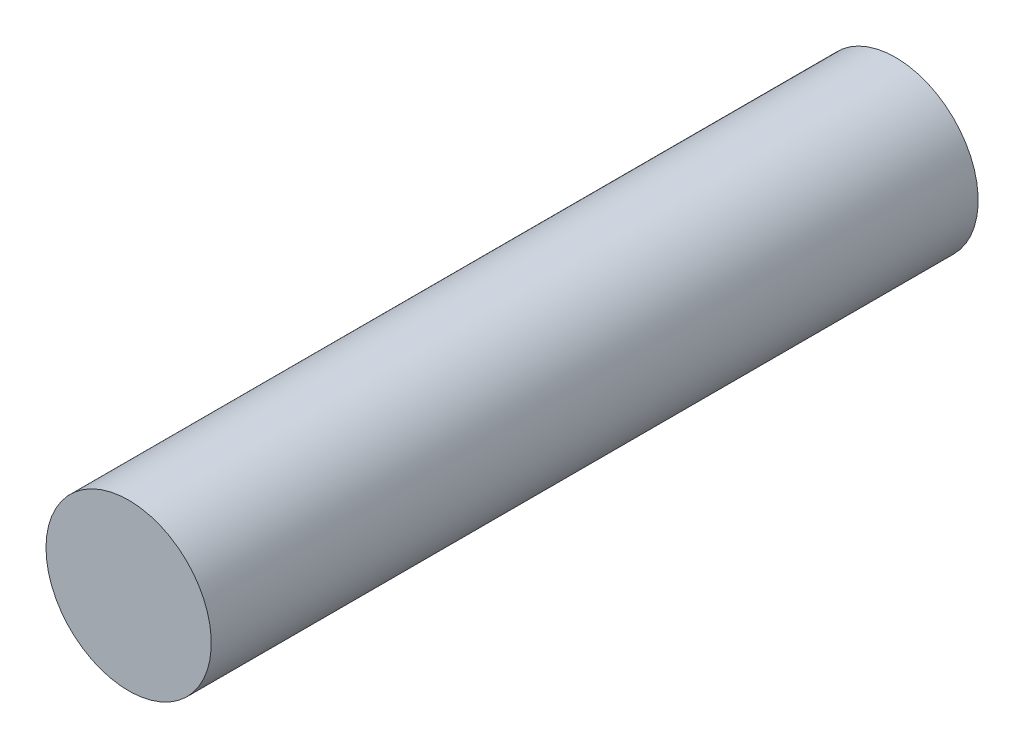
ISO-10303-21;
HEADER;
FILE_DESCRIPTION(('STEP AP214'),'2;1');
FILE_NAME('part.step','',(''),(''),'','','');
FILE_SCHEMA(('AUTOMOTIVE_DESIGN { 1 0 10303 214 1 1 1 1 }'));
ENDSEC;
DATA;
#1=APPLICATION_CONTEXT('core data for automotive mechanical design processes');
#2=APPLICATION_PROTOCOL_DEFINITION('international standard','automotive_design',2000,#1);
#3=PRODUCT_CONTEXT('',#1,'mechanical');
#4=PRODUCT('Part','Part','',(#3));
#5=PRODUCT_RELATED_PRODUCT_CATEGORY('part','',(#4));
#6=PRODUCT_DEFINITION_FORMATION('','',#4);
#7=PRODUCT_DEFINITION_CONTEXT('part definition',#1,'design');
#8=PRODUCT_DEFINITION('design','',#6,#7);
#9=PRODUCT_DEFINITION_SHAPE('','',#8);
#10=(LENGTH_UNIT() NAMED_UNIT(*) SI_UNIT(.MILLI.,.METRE.));
#11=(NAMED_UNIT(*) PLANE_ANGLE_UNIT() SI_UNIT($,.RADIAN.));
#12=(NAMED_UNIT(*) SI_UNIT($,.STERADIAN.) SOLID_ANGLE_UNIT());
#13=UNCERTAINTY_MEASURE_WITH_UNIT(LENGTH_MEASURE(1.E-05),#10,'distance_accuracy_value','');
#14=(GEOMETRIC_REPRESENTATION_CONTEXT(3) GLOBAL_UNCERTAINTY_ASSIGNED_CONTEXT((#13)) GLOBAL_UNIT_ASSIGNED_CONTEXT((#10,
#11,#12)) REPRESENTATION_CONTEXT('',''));
#15=CARTESIAN_POINT('',(0.,0.,0.));
#16=DIRECTION('',(0.,0.,1.));
#17=DIRECTION('',(1.,0.,0.));
#18=AXIS2_PLACEMENT_3D('',#15,#16,#17);
#19=CARTESIAN_POINT('',(0.,0.,46.4));
#20=DIRECTION('',(0.,0.,-1.));
#21=DIRECTION('',(-1.,0.,0.));
#22=AXIS2_PLACEMENT_3D('',#19,#20,#21);
#23=PLANE('',#22);
#24=CARTESIAN_POINT('',(0.,0.,46.4));
#25=DIRECTION('',(0.,0.,-1.));
#26=DIRECTION('',(-1.,0.,0.));
#27=AXIS2_PLACEMENT_3D('',#24,#25,#26);
#28=CIRCLE('',#27,5.);
#29=CARTESIAN_POINT('',(-5.,0.,46.4));
#30=VERTEX_POINT('',#29);
#31=EDGE_CURVE('E8',#30,#30,#28,.T.);
#32=ORIENTED_EDGE('',*,*,#31,.F.);
#33=EDGE_LOOP('',(#32));
#34=FACE_BOUND('',#33,.T.);
#35=ADVANCED_FACE('F12',(#34),#23,.F.);
#36=CARTESIAN_POINT('',(0.,0.,0.));
#37=DIRECTION('',(0.,0.,1.));
#38=DIRECTION('',(1.,0.,0.));
#39=AXIS2_PLACEMENT_3D('',#36,#37,#38);
#40=CYLINDRICAL_SURFACE('',#39,5.);
#41=CARTESIAN_POINT('',(0.,0.,0.));
#42=DIRECTION('',(0.,0.,-1.));
#43=DIRECTION('',(-1.,0.,0.));
#44=AXIS2_PLACEMENT_3D('',#41,#42,#43);
#45=CIRCLE('',#44,5.);
#46=CARTESIAN_POINT('',(-5.,0.,0.));
#47=VERTEX_POINT('',#46);
#48=EDGE_CURVE('E16',#47,#47,#45,.T.);
#49=ORIENTED_EDGE('',*,*,#48,.F.);
#50=EDGE_LOOP('',(#49));
#51=FACE_BOUND('',#50,.T.);
#52=ORIENTED_EDGE('',*,*,#31,.T.);
#53=EDGE_LOOP('',(#52));
#54=FACE_BOUND('',#53,.T.);
#55=ADVANCED_FACE('F14',(#51,#54),#40,.T.);
#56=CARTESIAN_POINT('',(0.,4.,0.));
#57=DIRECTION('',(0.,0.,-1.));
#58=DIRECTION('',(-1.,0.,0.));
#59=AXIS2_PLACEMENT_3D('',#56,#57,#58);
#60=PLANE('',#59);
#61=ORIENTED_EDGE('',*,*,#48,.T.);
#62=EDGE_LOOP('',(#61));
#63=FACE_BOUND('',#62,.T.);
#64=ADVANCED_FACE('F25',(#63),#60,.T.);
#65=CLOSED_SHELL('',(#35,#55,#64));
#66=MANIFOLD_SOLID_BREP('B1',#65);
#67=ADVANCED_BREP_SHAPE_REPRESENTATION('',(#18,#66),#14);
#68=SHAPE_DEFINITION_REPRESENTATION(#9,#67);
ENDSEC;
END-ISO-10303-21;
